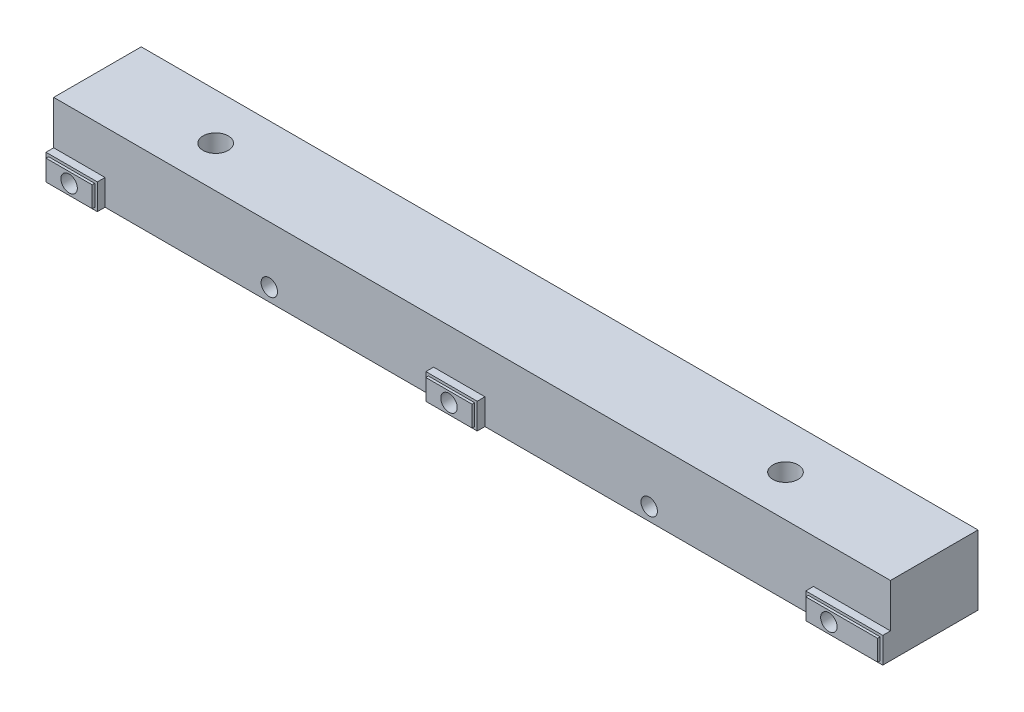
ISO-10303-21;
HEADER;
FILE_DESCRIPTION(('STEP AP214'),'2;1');
FILE_NAME('part.step','',(''),(''),'','','');
FILE_SCHEMA(('AUTOMOTIVE_DESIGN { 1 0 10303 214 1 1 1 1 }'));
ENDSEC;
DATA;
#1=APPLICATION_CONTEXT('core data for automotive mechanical design processes');
#2=APPLICATION_PROTOCOL_DEFINITION('international standard','automotive_design',2000,#1);
#3=PRODUCT_CONTEXT('',#1,'mechanical');
#4=PRODUCT('Part','Part','',(#3));
#5=PRODUCT_RELATED_PRODUCT_CATEGORY('part','',(#4));
#6=PRODUCT_DEFINITION_FORMATION('','',#4);
#7=PRODUCT_DEFINITION_CONTEXT('part definition',#1,'design');
#8=PRODUCT_DEFINITION('design','',#6,#7);
#9=PRODUCT_DEFINITION_SHAPE('','',#8);
#10=(LENGTH_UNIT() NAMED_UNIT(*) SI_UNIT(.MILLI.,.METRE.));
#11=(NAMED_UNIT(*) PLANE_ANGLE_UNIT() SI_UNIT($,.RADIAN.));
#12=(NAMED_UNIT(*) SI_UNIT($,.STERADIAN.) SOLID_ANGLE_UNIT());
#13=UNCERTAINTY_MEASURE_WITH_UNIT(LENGTH_MEASURE(1.E-05),#10,'distance_accuracy_value','');
#14=(GEOMETRIC_REPRESENTATION_CONTEXT(3) GLOBAL_UNCERTAINTY_ASSIGNED_CONTEXT((#13)) GLOBAL_UNIT_ASSIGNED_CONTEXT((#10,
#11,#12)) REPRESENTATION_CONTEXT('',''));
#15=CARTESIAN_POINT('',(0.,0.,0.));
#16=DIRECTION('',(0.,0.,1.));
#17=DIRECTION('',(1.,0.,0.));
#18=AXIS2_PLACEMENT_3D('',#15,#16,#17);
#19=CARTESIAN_POINT('',(-208.,0.,8.525));
#20=DIRECTION('',(0.,1.,0.));
#21=DIRECTION('',(0.,0.,1.));
#22=AXIS2_PLACEMENT_3D('',#19,#20,#21);
#23=PLANE('',#22);
#24=CARTESIAN_POINT('',(179.5,0.,0.475000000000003));
#25=DIRECTION('',(0.,-1.,0.));
#26=DIRECTION('',(0.,0.,-1.));
#27=AXIS2_PLACEMENT_3D('',#24,#25,#26);
#28=CIRCLE('',#27,2.79399999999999);
#29=CARTESIAN_POINT('',(179.5,0.,-2.31899999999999));
#30=VERTEX_POINT('',#29);
#31=EDGE_CURVE('E552',#30,#30,#28,.T.);
#32=ORIENTED_EDGE('',*,*,#31,.F.);
#33=EDGE_LOOP('',(#32));
#34=FACE_BOUND('',#33,.T.);
#35=CARTESIAN_POINT('',(68.4999999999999,0.,0.474999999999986));
#36=DIRECTION('',(0.,-1.,0.));
#37=DIRECTION('',(0.,0.,-1.));
#38=AXIS2_PLACEMENT_3D('',#35,#36,#37);
#39=CIRCLE('',#38,2.794);
#40=CARTESIAN_POINT('',(68.4999999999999,0.,-2.31900000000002));
#41=VERTEX_POINT('',#40);
#42=EDGE_CURVE('E563',#41,#41,#39,.T.);
#43=ORIENTED_EDGE('',*,*,#42,.F.);
#44=EDGE_LOOP('',(#43));
#45=FACE_BOUND('',#44,.T.);
#46=DIRECTION('',(1.,0.,0.));
#47=VECTOR('',#46,1.);
#48=CARTESIAN_POINT('',(-208.,0.,8.525));
#49=LINE('',#48,#47);
#50=CARTESIAN_POINT('',(129.,0.,8.525));
#51=VERTEX_POINT('',#50);
#52=CARTESIAN_POINT('',(193.,0.,8.525));
#53=VERTEX_POINT('',#52);
#54=EDGE_CURVE('E436',#51,#53,#49,.T.);
#55=ORIENTED_EDGE('',*,*,#54,.F.);
#56=DIRECTION('',(0.,0.,-1.));
#57=VECTOR('',#56,1.);
#58=CARTESIAN_POINT('',(129.,0.,10.525));
#59=LINE('',#58,#57);
#60=CARTESIAN_POINT('',(129.,0.,10.025));
#61=VERTEX_POINT('',#60);
#62=EDGE_CURVE('E427',#61,#51,#59,.T.);
#63=ORIENTED_EDGE('',*,*,#62,.F.);
#64=DIRECTION('',(1.,0.,0.));
#65=VECTOR('',#64,1.);
#66=CARTESIAN_POINT('',(119.,0.,10.025));
#67=LINE('',#66,#65);
#68=CARTESIAN_POINT('',(119.,0.,10.025));
#69=VERTEX_POINT('',#68);
#70=EDGE_CURVE('E306',#69,#61,#67,.T.);
#71=ORIENTED_EDGE('',*,*,#70,.F.);
#72=DIRECTION('',(0.,0.,-1.));
#73=VECTOR('',#72,1.);
#74=CARTESIAN_POINT('',(119.,0.,10.525));
#75=LINE('',#74,#73);
#76=CARTESIAN_POINT('',(119.,0.,8.525));
#77=VERTEX_POINT('',#76);
#78=EDGE_CURVE('E430',#69,#77,#75,.T.);
#79=ORIENTED_EDGE('',*,*,#78,.T.);
#80=CARTESIAN_POINT('',(55.,0.,8.525));
#81=VERTEX_POINT('',#80);
#82=EDGE_CURVE('E446',#81,#77,#49,.T.);
#83=ORIENTED_EDGE('',*,*,#82,.F.);
#84=DIRECTION('',(0.,0.,-1.));
#85=VECTOR('',#84,1.);
#86=CARTESIAN_POINT('',(55.,0.,10.525));
#87=LINE('',#86,#85);
#88=CARTESIAN_POINT('',(55.,0.,10.025));
#89=VERTEX_POINT('',#88);
#90=EDGE_CURVE('E411',#89,#81,#87,.T.);
#91=ORIENTED_EDGE('',*,*,#90,.F.);
#92=DIRECTION('',(1.,0.,0.));
#93=VECTOR('',#92,1.);
#94=CARTESIAN_POINT('',(45.,0.,10.025));
#95=LINE('',#94,#93);
#96=CARTESIAN_POINT('',(45.,0.,10.025));
#97=VERTEX_POINT('',#96);
#98=EDGE_CURVE('E347',#97,#89,#95,.T.);
#99=ORIENTED_EDGE('',*,*,#98,.F.);
#100=DIRECTION('',(0.,0.,-1.));
#101=VECTOR('',#100,1.);
#102=CARTESIAN_POINT('',(45.,0.,10.525));
#103=LINE('',#102,#101);
#104=CARTESIAN_POINT('',(44.9999999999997,0.,-8.525));
#105=VERTEX_POINT('',#104);
#106=EDGE_CURVE('E48',#97,#105,#103,.T.);
#107=ORIENTED_EDGE('',*,*,#106,.T.);
#108=DIRECTION('',(-1.,0.,0.));
#109=VECTOR('',#108,1.);
#110=CARTESIAN_POINT('',(-208.,0.,-8.525));
#111=LINE('',#110,#109);
#112=CARTESIAN_POINT('',(208.,0.,-8.525));
#113=VERTEX_POINT('',#112);
#114=EDGE_CURVE('E219',#113,#105,#111,.T.);
#115=ORIENTED_EDGE('',*,*,#114,.F.);
#116=DIRECTION('',(0.,0.,-1.));
#117=VECTOR('',#116,1.);
#118=CARTESIAN_POINT('',(208.,0.,-8.525));
#119=LINE('',#118,#117);
#120=CARTESIAN_POINT('',(208.,0.,10.025));
#121=VERTEX_POINT('',#120);
#122=EDGE_CURVE('E442',#121,#113,#119,.T.);
#123=ORIENTED_EDGE('',*,*,#122,.F.);
#124=DIRECTION('',(1.,0.,0.));
#125=VECTOR('',#124,1.);
#126=CARTESIAN_POINT('',(193.,0.,10.025));
#127=LINE('',#126,#125);
#128=CARTESIAN_POINT('',(193.,0.,10.025));
#129=VERTEX_POINT('',#128);
#130=EDGE_CURVE('E265',#129,#121,#127,.T.);
#131=ORIENTED_EDGE('',*,*,#130,.F.);
#132=DIRECTION('',(0.,0.,-1.));
#133=VECTOR('',#132,1.);
#134=CARTESIAN_POINT('',(193.,0.,10.525));
#135=LINE('',#134,#133);
#136=EDGE_CURVE('E400',#129,#53,#135,.T.);
#137=ORIENTED_EDGE('',*,*,#136,.T.);
#138=EDGE_LOOP('',(#55,#63,#71,#79,#83,#91,#99,#107,#115,#123,#131,#137));
#139=FACE_BOUND('',#138,.T.);
#140=ADVANCED_FACE('F31',(#34,#45,#139),#23,.F.);
#141=CARTESIAN_POINT('',(161.,2.515,-8.525));
#142=DIRECTION('',(0.,0.,-1.));
#143=DIRECTION('',(-1.,0.,0.));
#144=AXIS2_PLACEMENT_3D('',#141,#142,#143);
#145=CYLINDRICAL_SURFACE('',#144,1.59999999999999);
#146=CARTESIAN_POINT('',(161.,2.515,-8.425));
#147=DIRECTION('',(0.,0.,-1.));
#148=DIRECTION('',(-1.,0.,0.));
#149=AXIS2_PLACEMENT_3D('',#146,#147,#148);
#150=CIRCLE('',#149,1.59999999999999);
#151=CARTESIAN_POINT('',(159.4,2.515,-8.425));
#152=VERTEX_POINT('',#151);
#153=EDGE_CURVE('E384',#152,#152,#150,.T.);
#154=ORIENTED_EDGE('',*,*,#153,.T.);
#155=EDGE_LOOP('',(#154));
#156=FACE_BOUND('',#155,.T.);
#157=CARTESIAN_POINT('',(161.,2.515,8.525));
#158=DIRECTION('',(0.,0.,1.));
#159=DIRECTION('',(1.,0.,0.));
#160=AXIS2_PLACEMENT_3D('',#157,#158,#159);
#161=CIRCLE('',#160,1.59999999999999);
#162=CARTESIAN_POINT('',(162.6,2.515,8.525));
#163=VERTEX_POINT('',#162);
#164=EDGE_CURVE('E35',#163,#163,#161,.F.);
#165=ORIENTED_EDGE('',*,*,#164,.F.);
#166=EDGE_LOOP('',(#165));
#167=FACE_BOUND('',#166,.T.);
#168=ADVANCED_FACE('F511',(#156,#167),#145,.F.);
#169=CARTESIAN_POINT('',(87.,2.515,-8.525));
#170=DIRECTION('',(0.,0.,-1.));
#171=DIRECTION('',(-1.,0.,0.));
#172=AXIS2_PLACEMENT_3D('',#169,#170,#171);
#173=CYLINDRICAL_SURFACE('',#172,1.6);
#174=CARTESIAN_POINT('',(87.,2.515,-8.425));
#175=DIRECTION('',(0.,0.,-1.));
#176=DIRECTION('',(-1.,0.,0.));
#177=AXIS2_PLACEMENT_3D('',#174,#175,#176);
#178=CIRCLE('',#177,1.6);
#179=CARTESIAN_POINT('',(85.4,2.515,-8.425));
#180=VERTEX_POINT('',#179);
#181=EDGE_CURVE('E371',#180,#180,#178,.T.);
#182=ORIENTED_EDGE('',*,*,#181,.T.);
#183=EDGE_LOOP('',(#182));
#184=FACE_BOUND('',#183,.T.);
#185=CARTESIAN_POINT('',(87.,2.515,8.525));
#186=DIRECTION('',(0.,0.,1.));
#187=DIRECTION('',(1.,0.,0.));
#188=AXIS2_PLACEMENT_3D('',#185,#186,#187);
#189=CIRCLE('',#188,1.6);
#190=CARTESIAN_POINT('',(88.6,2.515,8.525));
#191=VERTEX_POINT('',#190);
#192=EDGE_CURVE('E565',#191,#191,#189,.F.);
#193=ORIENTED_EDGE('',*,*,#192,.F.);
#194=EDGE_LOOP('',(#193));
#195=FACE_BOUND('',#194,.T.);
#196=ADVANCED_FACE('F518',(#184,#195),#173,.F.);
#197=CARTESIAN_POINT('',(-208.,13.54,8.525));
#198=DIRECTION('',(0.,1.,0.));
#199=DIRECTION('',(0.,0.,1.));
#200=AXIS2_PLACEMENT_3D('',#197,#198,#199);
#201=PLANE('',#200);
#202=CARTESIAN_POINT('',(179.5,13.54,0.475000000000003));
#203=DIRECTION('',(0.,-1.,0.));
#204=DIRECTION('',(0.,0.,-1.));
#205=AXIS2_PLACEMENT_3D('',#202,#203,#204);
#206=CIRCLE('',#205,2.45745);
#207=CARTESIAN_POINT('',(179.5,13.54,-1.98245));
#208=VERTEX_POINT('',#207);
#209=EDGE_CURVE('E233',#208,#208,#206,.T.);
#210=ORIENTED_EDGE('',*,*,#209,.T.);
#211=EDGE_LOOP('',(#210));
#212=FACE_BOUND('',#211,.T.);
#213=DIRECTION('',(0.,0.,-1.));
#214=VECTOR('',#213,1.);
#215=CARTESIAN_POINT('',(44.9999999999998,13.54,8.52500000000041));
#216=LINE('',#215,#214);
#217=CARTESIAN_POINT('',(44.9999999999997,13.54,8.525));
#218=VERTEX_POINT('',#217);
#219=CARTESIAN_POINT('',(44.9999999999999,13.54,-8.525));
#220=VERTEX_POINT('',#219);
#221=EDGE_CURVE('E11',#218,#220,#216,.T.);
#222=ORIENTED_EDGE('',*,*,#221,.F.);
#223=DIRECTION('',(1.,0.,0.));
#224=VECTOR('',#223,1.);
#225=CARTESIAN_POINT('',(-208.,13.54,8.525));
#226=LINE('',#225,#224);
#227=CARTESIAN_POINT('',(208.,13.54,8.525));
#228=VERTEX_POINT('',#227);
#229=EDGE_CURVE('E437',#218,#228,#226,.T.);
#230=ORIENTED_EDGE('',*,*,#229,.T.);
#231=DIRECTION('',(0.,0.,-1.));
#232=VECTOR('',#231,1.);
#233=CARTESIAN_POINT('',(208.,13.54,-8.525));
#234=LINE('',#233,#232);
#235=CARTESIAN_POINT('',(208.,13.54,-8.525));
#236=VERTEX_POINT('',#235);
#237=EDGE_CURVE('E209',#228,#236,#234,.T.);
#238=ORIENTED_EDGE('',*,*,#237,.T.);
#239=DIRECTION('',(-1.,0.,0.));
#240=VECTOR('',#239,1.);
#241=CARTESIAN_POINT('',(-208.,13.54,-8.525));
#242=LINE('',#241,#240);
#243=EDGE_CURVE('E204',#236,#220,#242,.T.);
#244=ORIENTED_EDGE('',*,*,#243,.T.);
#245=EDGE_LOOP('',(#222,#230,#238,#244));
#246=FACE_BOUND('',#245,.T.);
#247=CARTESIAN_POINT('',(68.4999999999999,13.54,0.474999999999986));
#248=DIRECTION('',(0.,-1.,0.));
#249=DIRECTION('',(0.,0.,-1.));
#250=AXIS2_PLACEMENT_3D('',#247,#248,#249);
#251=CIRCLE('',#250,2.45745);
#252=CARTESIAN_POINT('',(68.4999999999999,13.54,-1.98245000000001));
#253=VERTEX_POINT('',#252);
#254=EDGE_CURVE('E555',#253,#253,#251,.T.);
#255=ORIENTED_EDGE('',*,*,#254,.T.);
#256=EDGE_LOOP('',(#255));
#257=FACE_BOUND('',#256,.T.);
#258=ADVANCED_FACE('F206',(#212,#246,#257),#201,.T.);
#259=CARTESIAN_POINT('',(208.,13.54,-8.525));
#260=DIRECTION('',(-1.,0.,0.));
#261=DIRECTION('',(0.,0.,1.));
#262=AXIS2_PLACEMENT_3D('',#259,#260,#261);
#263=PLANE('',#262);
#264=DIRECTION('',(0.,1.,0.));
#265=VECTOR('',#264,1.);
#266=CARTESIAN_POINT('',(208.,0.,10.025));
#267=LINE('',#266,#265);
#268=CARTESIAN_POINT('',(208.,5.03,10.025));
#269=VERTEX_POINT('',#268);
#270=EDGE_CURVE('E273',#121,#269,#267,.T.);
#271=ORIENTED_EDGE('',*,*,#270,.F.);
#272=ORIENTED_EDGE('',*,*,#122,.T.);
#273=DIRECTION('',(0.,-1.,0.));
#274=VECTOR('',#273,1.);
#275=CARTESIAN_POINT('',(208.,13.54,-8.525));
#276=LINE('',#275,#274);
#277=EDGE_CURVE('E213',#236,#113,#276,.T.);
#278=ORIENTED_EDGE('',*,*,#277,.F.);
#279=ORIENTED_EDGE('',*,*,#237,.F.);
#280=DIRECTION('',(0.,-1.,0.));
#281=VECTOR('',#280,1.);
#282=CARTESIAN_POINT('',(208.,13.54,8.525));
#283=LINE('',#282,#281);
#284=CARTESIAN_POINT('',(208.,5.03,8.525));
#285=VERTEX_POINT('',#284);
#286=EDGE_CURVE('E40',#228,#285,#283,.T.);
#287=ORIENTED_EDGE('',*,*,#286,.T.);
#288=DIRECTION('',(0.,0.,-1.));
#289=VECTOR('',#288,1.);
#290=CARTESIAN_POINT('',(208.,5.03,10.525));
#291=LINE('',#290,#289);
#292=EDGE_CURVE('E404',#269,#285,#291,.T.);
#293=ORIENTED_EDGE('',*,*,#292,.F.);
#294=EDGE_LOOP('',(#271,#272,#278,#279,#287,#293));
#295=FACE_BOUND('',#294,.T.);
#296=ADVANCED_FACE('F490',(#295),#263,.F.);
#297=CARTESIAN_POINT('',(208.,5.03,10.525));
#298=DIRECTION('',(0.,1.,0.));
#299=DIRECTION('',(0.,0.,1.));
#300=AXIS2_PLACEMENT_3D('',#297,#298,#299);
#301=PLANE('',#300);
#302=DIRECTION('',(0.,0.,-1.));
#303=VECTOR('',#302,1.);
#304=CARTESIAN_POINT('',(193.,5.03,10.525));
#305=LINE('',#304,#303);
#306=CARTESIAN_POINT('',(193.,5.03,10.025));
#307=VERTEX_POINT('',#306);
#308=CARTESIAN_POINT('',(193.,5.03,8.525));
#309=VERTEX_POINT('',#308);
#310=EDGE_CURVE('E402',#307,#309,#305,.T.);
#311=ORIENTED_EDGE('',*,*,#310,.F.);
#312=DIRECTION('',(-1.,0.,0.));
#313=VECTOR('',#312,1.);
#314=CARTESIAN_POINT('',(208.,5.03,10.025));
#315=LINE('',#314,#313);
#316=EDGE_CURVE('E275',#269,#307,#315,.T.);
#317=ORIENTED_EDGE('',*,*,#316,.F.);
#318=ORIENTED_EDGE('',*,*,#292,.T.);
#319=DIRECTION('',(1.,0.,0.));
#320=VECTOR('',#319,1.);
#321=CARTESIAN_POINT('',(208.,5.03,8.525));
#322=LINE('',#321,#320);
#323=EDGE_CURVE('E394',#309,#285,#322,.T.);
#324=ORIENTED_EDGE('',*,*,#323,.F.);
#325=EDGE_LOOP('',(#311,#317,#318,#324));
#326=FACE_BOUND('',#325,.T.);
#327=ADVANCED_FACE('F487',(#326),#301,.T.);
#328=CARTESIAN_POINT('',(193.,5.03,10.525));
#329=DIRECTION('',(-1.,0.,0.));
#330=DIRECTION('',(0.,0.,1.));
#331=AXIS2_PLACEMENT_3D('',#328,#329,#330);
#332=PLANE('',#331);
#333=ORIENTED_EDGE('',*,*,#136,.F.);
#334=DIRECTION('',(0.,-1.,0.));
#335=VECTOR('',#334,1.);
#336=CARTESIAN_POINT('',(193.,5.03,10.025));
#337=LINE('',#336,#335);
#338=EDGE_CURVE('E277',#307,#129,#337,.T.);
#339=ORIENTED_EDGE('',*,*,#338,.F.);
#340=ORIENTED_EDGE('',*,*,#310,.T.);
#341=DIRECTION('',(0.,1.,0.));
#342=VECTOR('',#341,1.);
#343=CARTESIAN_POINT('',(193.,5.03,8.525));
#344=LINE('',#343,#342);
#345=EDGE_CURVE('E397',#53,#309,#344,.T.);
#346=ORIENTED_EDGE('',*,*,#345,.F.);
#347=EDGE_LOOP('',(#333,#339,#340,#346));
#348=FACE_BOUND('',#347,.T.);
#349=ADVANCED_FACE('F482',(#348),#332,.T.);
#350=CARTESIAN_POINT('',(208.,0.,10.525));
#351=DIRECTION('',(0.,0.,1.));
#352=DIRECTION('',(-1.,0.,0.));
#353=AXIS2_PLACEMENT_3D('',#350,#351,#352);
#354=PLANE('',#353);
#355=CARTESIAN_POINT('',(198.,2.515,10.525));
#356=DIRECTION('',(0.,0.,1.));
#357=DIRECTION('',(1.,0.,0.));
#358=AXIS2_PLACEMENT_3D('',#355,#356,#357);
#359=CIRCLE('',#358,1.59999999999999);
#360=CARTESIAN_POINT('',(199.6,2.515,10.525));
#361=VERTEX_POINT('',#360);
#362=EDGE_CURVE('E393',#361,#361,#359,.T.);
#363=ORIENTED_EDGE('',*,*,#362,.F.);
#364=EDGE_LOOP('',(#363));
#365=FACE_BOUND('',#364,.T.);
#366=DIRECTION('',(0.,-1.,0.));
#367=VECTOR('',#366,1.);
#368=CARTESIAN_POINT('',(193.5,4.53,10.525));
#369=LINE('',#368,#367);
#370=CARTESIAN_POINT('',(193.5,4.53,10.525));
#371=VERTEX_POINT('',#370);
#372=CARTESIAN_POINT('',(193.5,0.5,10.525));
#373=VERTEX_POINT('',#372);
#374=EDGE_CURVE('E243',#371,#373,#369,.T.);
#375=ORIENTED_EDGE('',*,*,#374,.T.);
#376=DIRECTION('',(1.,0.,0.));
#377=VECTOR('',#376,1.);
#378=CARTESIAN_POINT('',(193.5,0.5,10.525));
#379=LINE('',#378,#377);
#380=CARTESIAN_POINT('',(207.5,0.5,10.525));
#381=VERTEX_POINT('',#380);
#382=EDGE_CURVE('E221',#373,#381,#379,.T.);
#383=ORIENTED_EDGE('',*,*,#382,.T.);
#384=DIRECTION('',(0.,1.,0.));
#385=VECTOR('',#384,1.);
#386=CARTESIAN_POINT('',(207.5,0.5,10.525));
#387=LINE('',#386,#385);
#388=CARTESIAN_POINT('',(207.5,4.53,10.525));
#389=VERTEX_POINT('',#388);
#390=EDGE_CURVE('E255',#381,#389,#387,.T.);
#391=ORIENTED_EDGE('',*,*,#390,.T.);
#392=DIRECTION('',(-1.,0.,0.));
#393=VECTOR('',#392,1.);
#394=CARTESIAN_POINT('',(207.5,4.53,10.525));
#395=LINE('',#394,#393);
#396=EDGE_CURVE('E258',#389,#371,#395,.T.);
#397=ORIENTED_EDGE('',*,*,#396,.T.);
#398=EDGE_LOOP('',(#375,#383,#391,#397));
#399=FACE_BOUND('',#398,.T.);
#400=ADVANCED_FACE('F581',(#365,#399),#354,.T.);
#401=CARTESIAN_POINT('',(129.,5.03,10.525));
#402=DIRECTION('',(1.,0.,0.));
#403=DIRECTION('',(0.,0.,-1.));
#404=AXIS2_PLACEMENT_3D('',#401,#402,#403);
#405=PLANE('',#404);
#406=DIRECTION('',(0.,0.,-1.));
#407=VECTOR('',#406,1.);
#408=CARTESIAN_POINT('',(129.,5.03,10.525));
#409=LINE('',#408,#407);
#410=CARTESIAN_POINT('',(129.,5.03,10.025));
#411=VERTEX_POINT('',#410);
#412=CARTESIAN_POINT('',(129.,5.03,8.525));
#413=VERTEX_POINT('',#412);
#414=EDGE_CURVE('E434',#411,#413,#409,.T.);
#415=ORIENTED_EDGE('',*,*,#414,.F.);
#416=DIRECTION('',(0.,1.,0.));
#417=VECTOR('',#416,1.);
#418=CARTESIAN_POINT('',(129.,0.,10.025));
#419=LINE('',#418,#417);
#420=EDGE_CURVE('E314',#61,#411,#419,.T.);
#421=ORIENTED_EDGE('',*,*,#420,.F.);
#422=ORIENTED_EDGE('',*,*,#62,.T.);
#423=DIRECTION('',(0.,-1.,0.));
#424=VECTOR('',#423,1.);
#425=CARTESIAN_POINT('',(129.,5.03,8.525));
#426=LINE('',#425,#424);
#427=EDGE_CURVE('E418',#413,#51,#426,.T.);
#428=ORIENTED_EDGE('',*,*,#427,.F.);
#429=EDGE_LOOP('',(#415,#421,#422,#428));
#430=FACE_BOUND('',#429,.T.);
#431=ADVANCED_FACE('F473',(#430),#405,.T.);
#432=CARTESIAN_POINT('',(129.,5.03,10.525));
#433=DIRECTION('',(0.,1.,0.));
#434=DIRECTION('',(0.,0.,1.));
#435=AXIS2_PLACEMENT_3D('',#432,#433,#434);
#436=PLANE('',#435);
#437=DIRECTION('',(0.,0.,-1.));
#438=VECTOR('',#437,1.);
#439=CARTESIAN_POINT('',(119.,5.03,10.525));
#440=LINE('',#439,#438);
#441=CARTESIAN_POINT('',(119.,5.03,10.025));
#442=VERTEX_POINT('',#441);
#443=CARTESIAN_POINT('',(119.,5.03,8.525));
#444=VERTEX_POINT('',#443);
#445=EDGE_CURVE('E432',#442,#444,#440,.T.);
#446=ORIENTED_EDGE('',*,*,#445,.F.);
#447=DIRECTION('',(-1.,0.,0.));
#448=VECTOR('',#447,1.);
#449=CARTESIAN_POINT('',(129.,5.03,10.025));
#450=LINE('',#449,#448);
#451=EDGE_CURVE('E316',#411,#442,#450,.T.);
#452=ORIENTED_EDGE('',*,*,#451,.F.);
#453=ORIENTED_EDGE('',*,*,#414,.T.);
#454=DIRECTION('',(1.,0.,0.));
#455=VECTOR('',#454,1.);
#456=CARTESIAN_POINT('',(129.,5.03,8.525));
#457=LINE('',#456,#455);
#458=EDGE_CURVE('E421',#444,#413,#457,.T.);
#459=ORIENTED_EDGE('',*,*,#458,.F.);
#460=EDGE_LOOP('',(#446,#452,#453,#459));
#461=FACE_BOUND('',#460,.T.);
#462=ADVANCED_FACE('F469',(#461),#436,.T.);
#463=CARTESIAN_POINT('',(119.,5.03,10.525));
#464=DIRECTION('',(-1.,0.,0.));
#465=DIRECTION('',(0.,0.,1.));
#466=AXIS2_PLACEMENT_3D('',#463,#464,#465);
#467=PLANE('',#466);
#468=ORIENTED_EDGE('',*,*,#78,.F.);
#469=DIRECTION('',(0.,-1.,0.));
#470=VECTOR('',#469,1.);
#471=CARTESIAN_POINT('',(119.,5.03,10.025));
#472=LINE('',#471,#470);
#473=EDGE_CURVE('E318',#442,#69,#472,.T.);
#474=ORIENTED_EDGE('',*,*,#473,.F.);
#475=ORIENTED_EDGE('',*,*,#445,.T.);
#476=DIRECTION('',(0.,1.,0.));
#477=VECTOR('',#476,1.);
#478=CARTESIAN_POINT('',(119.,5.03,8.525));
#479=LINE('',#478,#477);
#480=EDGE_CURVE('E424',#77,#444,#479,.T.);
#481=ORIENTED_EDGE('',*,*,#480,.F.);
#482=EDGE_LOOP('',(#468,#474,#475,#481));
#483=FACE_BOUND('',#482,.T.);
#484=ADVANCED_FACE('F464',(#483),#467,.T.);
#485=CARTESIAN_POINT('',(129.,0.,10.525));
#486=DIRECTION('',(0.,0.,1.));
#487=DIRECTION('',(-1.,0.,0.));
#488=AXIS2_PLACEMENT_3D('',#485,#486,#487);
#489=PLANE('',#488);
#490=CARTESIAN_POINT('',(124.,2.515,10.525));
#491=DIRECTION('',(0.,0.,1.));
#492=DIRECTION('',(1.,0.,0.));
#493=AXIS2_PLACEMENT_3D('',#490,#491,#492);
#494=CIRCLE('',#493,1.6);
#495=CARTESIAN_POINT('',(125.6,2.515,10.525));
#496=VERTEX_POINT('',#495);
#497=EDGE_CURVE('E380',#496,#496,#494,.T.);
#498=ORIENTED_EDGE('',*,*,#497,.F.);
#499=EDGE_LOOP('',(#498));
#500=FACE_BOUND('',#499,.T.);
#501=DIRECTION('',(0.,-1.,0.));
#502=VECTOR('',#501,1.);
#503=CARTESIAN_POINT('',(119.5,4.53,10.525));
#504=LINE('',#503,#502);
#505=CARTESIAN_POINT('',(119.5,4.53,10.525));
#506=VERTEX_POINT('',#505);
#507=CARTESIAN_POINT('',(119.5,0.5,10.525));
#508=VERTEX_POINT('',#507);
#509=EDGE_CURVE('E284',#506,#508,#504,.T.);
#510=ORIENTED_EDGE('',*,*,#509,.T.);
#511=DIRECTION('',(1.,0.,0.));
#512=VECTOR('',#511,1.);
#513=CARTESIAN_POINT('',(119.5,0.5,10.525));
#514=LINE('',#513,#512);
#515=CARTESIAN_POINT('',(128.5,0.5,10.525));
#516=VERTEX_POINT('',#515);
#517=EDGE_CURVE('E279',#508,#516,#514,.T.);
#518=ORIENTED_EDGE('',*,*,#517,.T.);
#519=DIRECTION('',(0.,1.,0.));
#520=VECTOR('',#519,1.);
#521=CARTESIAN_POINT('',(128.5,0.5,10.525));
#522=LINE('',#521,#520);
#523=CARTESIAN_POINT('',(128.5,4.53,10.525));
#524=VERTEX_POINT('',#523);
#525=EDGE_CURVE('E296',#516,#524,#522,.T.);
#526=ORIENTED_EDGE('',*,*,#525,.T.);
#527=DIRECTION('',(-1.,0.,0.));
#528=VECTOR('',#527,1.);
#529=CARTESIAN_POINT('',(128.5,4.53,10.525));
#530=LINE('',#529,#528);
#531=EDGE_CURVE('E299',#524,#506,#530,.T.);
#532=ORIENTED_EDGE('',*,*,#531,.T.);
#533=EDGE_LOOP('',(#510,#518,#526,#532));
#534=FACE_BOUND('',#533,.T.);
#535=ADVANCED_FACE('F761',(#500,#534),#489,.T.);
#536=CARTESIAN_POINT('',(55.,5.03,10.525));
#537=DIRECTION('',(1.,0.,0.));
#538=DIRECTION('',(0.,0.,-1.));
#539=AXIS2_PLACEMENT_3D('',#536,#537,#538);
#540=PLANE('',#539);
#541=DIRECTION('',(0.,0.,-1.));
#542=VECTOR('',#541,1.);
#543=CARTESIAN_POINT('',(55.,5.03,10.525));
#544=LINE('',#543,#542);
#545=CARTESIAN_POINT('',(55.,5.03,10.025));
#546=VERTEX_POINT('',#545);
#547=CARTESIAN_POINT('',(55.,5.03,8.525));
#548=VERTEX_POINT('',#547);
#549=EDGE_CURVE('E416',#546,#548,#544,.T.);
#550=ORIENTED_EDGE('',*,*,#549,.F.);
#551=DIRECTION('',(0.,1.,0.));
#552=VECTOR('',#551,1.);
#553=CARTESIAN_POINT('',(55.,0.,10.025));
#554=LINE('',#553,#552);
#555=EDGE_CURVE('E355',#89,#546,#554,.T.);
#556=ORIENTED_EDGE('',*,*,#555,.F.);
#557=ORIENTED_EDGE('',*,*,#90,.T.);
#558=DIRECTION('',(0.,-1.,0.));
#559=VECTOR('',#558,1.);
#560=CARTESIAN_POINT('',(55.,5.03,8.525));
#561=LINE('',#560,#559);
#562=EDGE_CURVE('E406',#548,#81,#561,.T.);
#563=ORIENTED_EDGE('',*,*,#562,.F.);
#564=EDGE_LOOP('',(#550,#556,#557,#563));
#565=FACE_BOUND('',#564,.T.);
#566=ADVANCED_FACE('F752',(#565),#540,.T.);
#567=CARTESIAN_POINT('',(55.,5.03,10.525));
#568=DIRECTION('',(0.,1.,0.));
#569=DIRECTION('',(0.,0.,1.));
#570=AXIS2_PLACEMENT_3D('',#567,#568,#569);
#571=PLANE('',#570);
#572=DIRECTION('',(0.,0.,-1.));
#573=VECTOR('',#572,1.);
#574=CARTESIAN_POINT('',(45.,5.03,10.525));
#575=LINE('',#574,#573);
#576=CARTESIAN_POINT('',(45.,5.03,10.025));
#577=VERTEX_POINT('',#576);
#578=CARTESIAN_POINT('',(45.,5.03,8.525));
#579=VERTEX_POINT('',#578);
#580=EDGE_CURVE('E229',#577,#579,#575,.T.);
#581=ORIENTED_EDGE('',*,*,#580,.F.);
#582=DIRECTION('',(-1.,0.,0.));
#583=VECTOR('',#582,1.);
#584=CARTESIAN_POINT('',(55.,5.03,10.025));
#585=LINE('',#584,#583);
#586=EDGE_CURVE('E357',#546,#577,#585,.T.);
#587=ORIENTED_EDGE('',*,*,#586,.F.);
#588=ORIENTED_EDGE('',*,*,#549,.T.);
#589=DIRECTION('',(1.,0.,0.));
#590=VECTOR('',#589,1.);
#591=CARTESIAN_POINT('',(55.,5.03,8.525));
#592=LINE('',#591,#590);
#593=EDGE_CURVE('E409',#579,#548,#592,.T.);
#594=ORIENTED_EDGE('',*,*,#593,.F.);
#595=EDGE_LOOP('',(#581,#587,#588,#594));
#596=FACE_BOUND('',#595,.T.);
#597=ADVANCED_FACE('F741',(#596),#571,.T.);
#598=CARTESIAN_POINT('',(45.,5.03,10.525));
#599=DIRECTION('',(-1.,0.,0.));
#600=DIRECTION('',(0.,0.,1.));
#601=AXIS2_PLACEMENT_3D('',#598,#599,#600);
#602=PLANE('',#601);
#603=ORIENTED_EDGE('',*,*,#106,.F.);
#604=DIRECTION('',(0.,-1.,0.));
#605=VECTOR('',#604,1.);
#606=CARTESIAN_POINT('',(45.,5.03,10.025));
#607=LINE('',#606,#605);
#608=EDGE_CURVE('E359',#577,#97,#607,.T.);
#609=ORIENTED_EDGE('',*,*,#608,.F.);
#610=ORIENTED_EDGE('',*,*,#580,.T.);
#611=DIRECTION('',(0.,1.,0.));
#612=VECTOR('',#611,1.);
#613=CARTESIAN_POINT('',(44.9999999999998,-520.820019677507,8.525));
#614=LINE('',#613,#612);
#615=EDGE_CURVE('E222',#579,#218,#614,.T.);
#616=ORIENTED_EDGE('',*,*,#615,.T.);
#617=ORIENTED_EDGE('',*,*,#221,.T.);
#618=DIRECTION('',(0.,1.,0.));
#619=VECTOR('',#618,1.);
#620=CARTESIAN_POINT('',(44.9999999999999,-520.820019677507,-8.525));
#621=LINE('',#620,#619);
#622=EDGE_CURVE('E216',#105,#220,#621,.T.);
#623=ORIENTED_EDGE('',*,*,#622,.F.);
#624=EDGE_LOOP('',(#603,#609,#610,#616,#617,#623));
#625=FACE_BOUND('',#624,.T.);
#626=ADVANCED_FACE('F225',(#625),#602,.T.);
#627=CARTESIAN_POINT('',(55.,0.,10.525));
#628=DIRECTION('',(0.,0.,1.));
#629=DIRECTION('',(-1.,0.,0.));
#630=AXIS2_PLACEMENT_3D('',#627,#628,#629);
#631=PLANE('',#630);
#632=CARTESIAN_POINT('',(50.,2.515,10.525));
#633=DIRECTION('',(0.,0.,1.));
#634=DIRECTION('',(1.,0.,0.));
#635=AXIS2_PLACEMENT_3D('',#632,#633,#634);
#636=CIRCLE('',#635,1.6);
#637=CARTESIAN_POINT('',(51.6,2.515,10.525));
#638=VERTEX_POINT('',#637);
#639=EDGE_CURVE('E367',#638,#638,#636,.T.);
#640=ORIENTED_EDGE('',*,*,#639,.F.);
#641=EDGE_LOOP('',(#640));
#642=FACE_BOUND('',#641,.T.);
#643=DIRECTION('',(0.,-1.,0.));
#644=VECTOR('',#643,1.);
#645=CARTESIAN_POINT('',(45.5,4.53,10.525));
#646=LINE('',#645,#644);
#647=CARTESIAN_POINT('',(45.5,4.53,10.525));
#648=VERTEX_POINT('',#647);
#649=CARTESIAN_POINT('',(45.5,0.5,10.525));
#650=VERTEX_POINT('',#649);
#651=EDGE_CURVE('E325',#648,#650,#646,.T.);
#652=ORIENTED_EDGE('',*,*,#651,.T.);
#653=DIRECTION('',(1.,0.,0.));
#654=VECTOR('',#653,1.);
#655=CARTESIAN_POINT('',(45.5,0.5,10.525));
#656=LINE('',#655,#654);
#657=CARTESIAN_POINT('',(54.5,0.5,10.525));
#658=VERTEX_POINT('',#657);
#659=EDGE_CURVE('E320',#650,#658,#656,.T.);
#660=ORIENTED_EDGE('',*,*,#659,.T.);
#661=DIRECTION('',(0.,1.,0.));
#662=VECTOR('',#661,1.);
#663=CARTESIAN_POINT('',(54.5,0.5,10.525));
#664=LINE('',#663,#662);
#665=CARTESIAN_POINT('',(54.5,4.53,10.525));
#666=VERTEX_POINT('',#665);
#667=EDGE_CURVE('E337',#658,#666,#664,.T.);
#668=ORIENTED_EDGE('',*,*,#667,.T.);
#669=DIRECTION('',(-1.,0.,0.));
#670=VECTOR('',#669,1.);
#671=CARTESIAN_POINT('',(54.5,4.53,10.525));
#672=LINE('',#671,#670);
#673=EDGE_CURVE('E340',#666,#648,#672,.T.);
#674=ORIENTED_EDGE('',*,*,#673,.T.);
#675=EDGE_LOOP('',(#652,#660,#668,#674));
#676=FACE_BOUND('',#675,.T.);
#677=ADVANCED_FACE('F527',(#642,#676),#631,.T.);
#678=CARTESIAN_POINT('',(-208.,13.54,-8.525));
#679=DIRECTION('',(0.,0.,1.));
#680=DIRECTION('',(1.,0.,0.));
#681=AXIS2_PLACEMENT_3D('',#678,#679,#680);
#682=PLANE('',#681);
#683=CARTESIAN_POINT('',(50.,2.515,-8.525));
#684=DIRECTION('',(0.,0.,-1.));
#685=DIRECTION('',(-1.,0.,0.));
#686=AXIS2_PLACEMENT_3D('',#683,#684,#685);
#687=CIRCLE('',#686,1.7);
#688=CARTESIAN_POINT('',(48.3,2.515,-8.525));
#689=VERTEX_POINT('',#688);
#690=EDGE_CURVE('E361',#689,#689,#687,.T.);
#691=ORIENTED_EDGE('',*,*,#690,.F.);
#692=EDGE_LOOP('',(#691));
#693=FACE_BOUND('',#692,.T.);
#694=CARTESIAN_POINT('',(124.,2.515,-8.525));
#695=DIRECTION('',(0.,0.,-1.));
#696=DIRECTION('',(-1.,0.,0.));
#697=AXIS2_PLACEMENT_3D('',#694,#695,#696);
#698=CIRCLE('',#697,1.69999999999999);
#699=CARTESIAN_POINT('',(122.3,2.515,-8.525));
#700=VERTEX_POINT('',#699);
#701=EDGE_CURVE('E374',#700,#700,#698,.T.);
#702=ORIENTED_EDGE('',*,*,#701,.F.);
#703=EDGE_LOOP('',(#702));
#704=FACE_BOUND('',#703,.T.);
#705=ORIENTED_EDGE('',*,*,#114,.T.);
#706=ORIENTED_EDGE('',*,*,#622,.T.);
#707=ORIENTED_EDGE('',*,*,#243,.F.);
#708=ORIENTED_EDGE('',*,*,#277,.T.);
#709=EDGE_LOOP('',(#705,#706,#707,#708));
#710=FACE_BOUND('',#709,.T.);
#711=CARTESIAN_POINT('',(198.,2.515,-8.525));
#712=DIRECTION('',(0.,0.,-1.));
#713=DIRECTION('',(-1.,0.,0.));
#714=AXIS2_PLACEMENT_3D('',#711,#712,#713);
#715=CIRCLE('',#714,1.70000000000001);
#716=CARTESIAN_POINT('',(196.3,2.515,-8.525));
#717=VERTEX_POINT('',#716);
#718=EDGE_CURVE('E387',#717,#717,#715,.T.);
#719=ORIENTED_EDGE('',*,*,#718,.F.);
#720=EDGE_LOOP('',(#719));
#721=FACE_BOUND('',#720,.T.);
#722=CARTESIAN_POINT('',(161.,2.515,-8.525));
#723=DIRECTION('',(0.,0.,-1.));
#724=DIRECTION('',(-1.,0.,0.));
#725=AXIS2_PLACEMENT_3D('',#722,#723,#724);
#726=CIRCLE('',#725,1.70000000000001);
#727=CARTESIAN_POINT('',(159.3,2.515,-8.525));
#728=VERTEX_POINT('',#727);
#729=EDGE_CURVE('E381',#728,#728,#726,.T.);
#730=ORIENTED_EDGE('',*,*,#729,.F.);
#731=EDGE_LOOP('',(#730));
#732=FACE_BOUND('',#731,.T.);
#733=CARTESIAN_POINT('',(87.,2.515,-8.525));
#734=DIRECTION('',(0.,0.,-1.));
#735=DIRECTION('',(-1.,0.,0.));
#736=AXIS2_PLACEMENT_3D('',#733,#734,#735);
#737=CIRCLE('',#736,1.69999999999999);
#738=CARTESIAN_POINT('',(85.3,2.515,-8.525));
#739=VERTEX_POINT('',#738);
#740=EDGE_CURVE('E368',#739,#739,#737,.T.);
#741=ORIENTED_EDGE('',*,*,#740,.F.);
#742=EDGE_LOOP('',(#741));
#743=FACE_BOUND('',#742,.T.);
#744=ADVANCED_FACE('F217',(#693,#704,#710,#721,#732,#743),#682,.F.);
#745=CARTESIAN_POINT('',(-208.,13.54,8.525));
#746=DIRECTION('',(0.,0.,-1.));
#747=DIRECTION('',(-1.,0.,0.));
#748=AXIS2_PLACEMENT_3D('',#745,#746,#747);
#749=PLANE('',#748);
#750=ORIENTED_EDGE('',*,*,#427,.T.);
#751=ORIENTED_EDGE('',*,*,#54,.T.);
#752=ORIENTED_EDGE('',*,*,#345,.T.);
#753=ORIENTED_EDGE('',*,*,#323,.T.);
#754=ORIENTED_EDGE('',*,*,#286,.F.);
#755=ORIENTED_EDGE('',*,*,#229,.F.);
#756=ORIENTED_EDGE('',*,*,#615,.F.);
#757=ORIENTED_EDGE('',*,*,#593,.T.);
#758=ORIENTED_EDGE('',*,*,#562,.T.);
#759=ORIENTED_EDGE('',*,*,#82,.T.);
#760=ORIENTED_EDGE('',*,*,#480,.T.);
#761=ORIENTED_EDGE('',*,*,#458,.T.);
#762=EDGE_LOOP('',(#750,#751,#752,#753,#754,#755,#756,#757,#758,#759,#760,#761));
#763=FACE_BOUND('',#762,.T.);
#764=ORIENTED_EDGE('',*,*,#192,.T.);
#765=EDGE_LOOP('',(#764));
#766=FACE_BOUND('',#765,.T.);
#767=ORIENTED_EDGE('',*,*,#164,.T.);
#768=EDGE_LOOP('',(#767));
#769=FACE_BOUND('',#768,.T.);
#770=ADVANCED_FACE('F33',(#763,#766,#769),#749,.F.);
#771=CARTESIAN_POINT('',(198.,2.515,-8.525));
#772=DIRECTION('',(0.,0.,-1.));
#773=DIRECTION('',(-1.,0.,0.));
#774=AXIS2_PLACEMENT_3D('',#771,#772,#773);
#775=CYLINDRICAL_SURFACE('',#774,1.59999999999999);
#776=ORIENTED_EDGE('',*,*,#362,.T.);
#777=EDGE_LOOP('',(#776));
#778=FACE_BOUND('',#777,.T.);
#779=CARTESIAN_POINT('',(198.,2.515,-8.425));
#780=DIRECTION('',(0.,0.,-1.));
#781=DIRECTION('',(-1.,0.,0.));
#782=AXIS2_PLACEMENT_3D('',#779,#780,#781);
#783=CIRCLE('',#782,1.59999999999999);
#784=CARTESIAN_POINT('',(196.4,2.515,-8.425));
#785=VERTEX_POINT('',#784);
#786=EDGE_CURVE('E390',#785,#785,#783,.T.);
#787=ORIENTED_EDGE('',*,*,#786,.T.);
#788=EDGE_LOOP('',(#787));
#789=FACE_BOUND('',#788,.T.);
#790=ADVANCED_FACE('F578',(#778,#789),#775,.F.);
#791=CARTESIAN_POINT('',(198.,2.515,-8.525));
#792=DIRECTION('',(0.,0.,-1.));
#793=DIRECTION('',(-1.,0.,0.));
#794=AXIS2_PLACEMENT_3D('',#791,#792,#793);
#795=CONICAL_SURFACE('',#794,1.70000000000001,0.785398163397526);
#796=ORIENTED_EDGE('',*,*,#786,.F.);
#797=EDGE_LOOP('',(#796));
#798=FACE_BOUND('',#797,.T.);
#799=ORIENTED_EDGE('',*,*,#718,.T.);
#800=EDGE_LOOP('',(#799));
#801=FACE_BOUND('',#800,.T.);
#802=ADVANCED_FACE('F654',(#798,#801),#795,.F.);
#803=CARTESIAN_POINT('',(161.,2.515,-8.525));
#804=DIRECTION('',(0.,0.,-1.));
#805=DIRECTION('',(-1.,0.,0.));
#806=AXIS2_PLACEMENT_3D('',#803,#804,#805);
#807=CONICAL_SURFACE('',#806,1.70000000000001,0.785398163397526);
#808=ORIENTED_EDGE('',*,*,#153,.F.);
#809=EDGE_LOOP('',(#808));
#810=FACE_BOUND('',#809,.T.);
#811=ORIENTED_EDGE('',*,*,#729,.T.);
#812=EDGE_LOOP('',(#811));
#813=FACE_BOUND('',#812,.T.);
#814=ADVANCED_FACE('F662',(#810,#813),#807,.F.);
#815=CARTESIAN_POINT('',(124.,2.515,-8.525));
#816=DIRECTION('',(0.,0.,-1.));
#817=DIRECTION('',(-1.,0.,0.));
#818=AXIS2_PLACEMENT_3D('',#815,#816,#817);
#819=CYLINDRICAL_SURFACE('',#818,1.6);
#820=ORIENTED_EDGE('',*,*,#497,.T.);
#821=EDGE_LOOP('',(#820));
#822=FACE_BOUND('',#821,.T.);
#823=CARTESIAN_POINT('',(124.,2.515,-8.425));
#824=DIRECTION('',(0.,0.,-1.));
#825=DIRECTION('',(-1.,0.,0.));
#826=AXIS2_PLACEMENT_3D('',#823,#824,#825);
#827=CIRCLE('',#826,1.6);
#828=CARTESIAN_POINT('',(122.4,2.515,-8.425));
#829=VERTEX_POINT('',#828);
#830=EDGE_CURVE('E377',#829,#829,#827,.T.);
#831=ORIENTED_EDGE('',*,*,#830,.T.);
#832=EDGE_LOOP('',(#831));
#833=FACE_BOUND('',#832,.T.);
#834=ADVANCED_FACE('F671',(#822,#833),#819,.F.);
#835=CARTESIAN_POINT('',(124.,2.515,-8.525));
#836=DIRECTION('',(0.,0.,-1.));
#837=DIRECTION('',(-1.,0.,0.));
#838=AXIS2_PLACEMENT_3D('',#835,#836,#837);
#839=CONICAL_SURFACE('',#838,1.69999999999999,0.785398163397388);
#840=ORIENTED_EDGE('',*,*,#830,.F.);
#841=EDGE_LOOP('',(#840));
#842=FACE_BOUND('',#841,.T.);
#843=ORIENTED_EDGE('',*,*,#701,.T.);
#844=EDGE_LOOP('',(#843));
#845=FACE_BOUND('',#844,.T.);
#846=ADVANCED_FACE('F680',(#842,#845),#839,.F.);
#847=CARTESIAN_POINT('',(87.,2.515,-8.525));
#848=DIRECTION('',(0.,0.,-1.));
#849=DIRECTION('',(-1.,0.,0.));
#850=AXIS2_PLACEMENT_3D('',#847,#848,#849);
#851=CONICAL_SURFACE('',#850,1.69999999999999,0.785398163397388);
#852=ORIENTED_EDGE('',*,*,#181,.F.);
#853=EDGE_LOOP('',(#852));
#854=FACE_BOUND('',#853,.T.);
#855=ORIENTED_EDGE('',*,*,#740,.T.);
#856=EDGE_LOOP('',(#855));
#857=FACE_BOUND('',#856,.T.);
#858=ADVANCED_FACE('F689',(#854,#857),#851,.F.);
#859=CARTESIAN_POINT('',(50.,2.515,-8.525));
#860=DIRECTION('',(0.,0.,-1.));
#861=DIRECTION('',(-1.,0.,0.));
#862=AXIS2_PLACEMENT_3D('',#859,#860,#861);
#863=CYLINDRICAL_SURFACE('',#862,1.6);
#864=ORIENTED_EDGE('',*,*,#639,.T.);
#865=EDGE_LOOP('',(#864));
#866=FACE_BOUND('',#865,.T.);
#867=CARTESIAN_POINT('',(50.,2.515,-8.425));
#868=DIRECTION('',(0.,0.,-1.));
#869=DIRECTION('',(-1.,0.,0.));
#870=AXIS2_PLACEMENT_3D('',#867,#868,#869);
#871=CIRCLE('',#870,1.6);
#872=CARTESIAN_POINT('',(48.4,2.515,-8.425));
#873=VERTEX_POINT('',#872);
#874=EDGE_CURVE('E364',#873,#873,#871,.T.);
#875=ORIENTED_EDGE('',*,*,#874,.T.);
#876=EDGE_LOOP('',(#875));
#877=FACE_BOUND('',#876,.T.);
#878=ADVANCED_FACE('F698',(#866,#877),#863,.F.);
#879=CARTESIAN_POINT('',(50.,2.515,-8.525));
#880=DIRECTION('',(0.,0.,-1.));
#881=DIRECTION('',(-1.,0.,0.));
#882=AXIS2_PLACEMENT_3D('',#879,#880,#881);
#883=CONICAL_SURFACE('',#882,1.7,0.785398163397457);
#884=ORIENTED_EDGE('',*,*,#874,.F.);
#885=EDGE_LOOP('',(#884));
#886=FACE_BOUND('',#885,.T.);
#887=ORIENTED_EDGE('',*,*,#690,.T.);
#888=EDGE_LOOP('',(#887));
#889=FACE_BOUND('',#888,.T.);
#890=ADVANCED_FACE('F707',(#886,#889),#883,.F.);
#891=CARTESIAN_POINT('',(55.,0.,10.025));
#892=DIRECTION('',(0.,0.,1.));
#893=DIRECTION('',(1.,0.,0.));
#894=AXIS2_PLACEMENT_3D('',#891,#892,#893);
#895=PLANE('',#894);
#896=DIRECTION('',(0.,-1.,0.));
#897=VECTOR('',#896,1.);
#898=CARTESIAN_POINT('',(45.5,4.53,10.025));
#899=LINE('',#898,#897);
#900=CARTESIAN_POINT('',(45.5,4.53,10.025));
#901=VERTEX_POINT('',#900);
#902=CARTESIAN_POINT('',(45.5,0.5,10.025));
#903=VERTEX_POINT('',#902);
#904=EDGE_CURVE('E331',#901,#903,#899,.T.);
#905=ORIENTED_EDGE('',*,*,#904,.F.);
#906=DIRECTION('',(-1.,0.,0.));
#907=VECTOR('',#906,1.);
#908=CARTESIAN_POINT('',(54.5,4.53,10.025));
#909=LINE('',#908,#907);
#910=CARTESIAN_POINT('',(54.5,4.53,10.025));
#911=VERTEX_POINT('',#910);
#912=EDGE_CURVE('E328',#911,#901,#909,.T.);
#913=ORIENTED_EDGE('',*,*,#912,.F.);
#914=DIRECTION('',(0.,1.,0.));
#915=VECTOR('',#914,1.);
#916=CARTESIAN_POINT('',(54.5,0.5,10.025));
#917=LINE('',#916,#915);
#918=CARTESIAN_POINT('',(54.5,0.5,10.025));
#919=VERTEX_POINT('',#918);
#920=EDGE_CURVE('E324',#919,#911,#917,.T.);
#921=ORIENTED_EDGE('',*,*,#920,.F.);
#922=DIRECTION('',(1.,0.,0.));
#923=VECTOR('',#922,1.);
#924=CARTESIAN_POINT('',(45.5,0.5,10.025));
#925=LINE('',#924,#923);
#926=EDGE_CURVE('E321',#903,#919,#925,.T.);
#927=ORIENTED_EDGE('',*,*,#926,.F.);
#928=EDGE_LOOP('',(#905,#913,#921,#927));
#929=FACE_BOUND('',#928,.T.);
#930=ORIENTED_EDGE('',*,*,#98,.T.);
#931=ORIENTED_EDGE('',*,*,#555,.T.);
#932=ORIENTED_EDGE('',*,*,#586,.T.);
#933=ORIENTED_EDGE('',*,*,#608,.T.);
#934=EDGE_LOOP('',(#930,#931,#932,#933));
#935=FACE_BOUND('',#934,.T.);
#936=ADVANCED_FACE('F716',(#929,#935),#895,.T.);
#937=CARTESIAN_POINT('',(45.5,0.5,10.025));
#938=DIRECTION('',(0.,-1.,0.));
#939=DIRECTION('',(0.,0.,-1.));
#940=AXIS2_PLACEMENT_3D('',#937,#938,#939);
#941=PLANE('',#940);
#942=ORIENTED_EDGE('',*,*,#659,.F.);
#943=DIRECTION('',(0.,0.,1.));
#944=VECTOR('',#943,1.);
#945=CARTESIAN_POINT('',(45.5,0.5,10.025));
#946=LINE('',#945,#944);
#947=EDGE_CURVE('E345',#903,#650,#946,.T.);
#948=ORIENTED_EDGE('',*,*,#947,.F.);
#949=ORIENTED_EDGE('',*,*,#926,.T.);
#950=DIRECTION('',(0.,0.,1.));
#951=VECTOR('',#950,1.);
#952=CARTESIAN_POINT('',(54.5,0.5,10.025));
#953=LINE('',#952,#951);
#954=EDGE_CURVE('E334',#919,#658,#953,.T.);
#955=ORIENTED_EDGE('',*,*,#954,.T.);
#956=EDGE_LOOP('',(#942,#948,#949,#955));
#957=FACE_BOUND('',#956,.T.);
#958=ADVANCED_FACE('F821',(#957),#941,.T.);
#959=CARTESIAN_POINT('',(45.5,4.53,10.025));
#960=DIRECTION('',(-1.,0.,0.));
#961=DIRECTION('',(0.,0.,1.));
#962=AXIS2_PLACEMENT_3D('',#959,#960,#961);
#963=PLANE('',#962);
#964=ORIENTED_EDGE('',*,*,#651,.F.);
#965=DIRECTION('',(0.,0.,1.));
#966=VECTOR('',#965,1.);
#967=CARTESIAN_POINT('',(45.5,4.53,10.025));
#968=LINE('',#967,#966);
#969=EDGE_CURVE('E348',#901,#648,#968,.T.);
#970=ORIENTED_EDGE('',*,*,#969,.F.);
#971=ORIENTED_EDGE('',*,*,#904,.T.);
#972=ORIENTED_EDGE('',*,*,#947,.T.);
#973=EDGE_LOOP('',(#964,#970,#971,#972));
#974=FACE_BOUND('',#973,.T.);
#975=ADVANCED_FACE('F830',(#974),#963,.T.);
#976=CARTESIAN_POINT('',(54.5,4.53,10.025));
#977=DIRECTION('',(0.,1.,0.));
#978=DIRECTION('',(0.,0.,1.));
#979=AXIS2_PLACEMENT_3D('',#976,#977,#978);
#980=PLANE('',#979);
#981=ORIENTED_EDGE('',*,*,#673,.F.);
#982=DIRECTION('',(0.,0.,1.));
#983=VECTOR('',#982,1.);
#984=CARTESIAN_POINT('',(54.5,4.53,10.025));
#985=LINE('',#984,#983);
#986=EDGE_CURVE('E350',#911,#666,#985,.T.);
#987=ORIENTED_EDGE('',*,*,#986,.F.);
#988=ORIENTED_EDGE('',*,*,#912,.T.);
#989=ORIENTED_EDGE('',*,*,#969,.T.);
#990=EDGE_LOOP('',(#981,#987,#988,#989));
#991=FACE_BOUND('',#990,.T.);
#992=ADVANCED_FACE('F839',(#991),#980,.T.);
#993=CARTESIAN_POINT('',(54.5,0.5,10.025));
#994=DIRECTION('',(1.,0.,0.));
#995=DIRECTION('',(0.,0.,-1.));
#996=AXIS2_PLACEMENT_3D('',#993,#994,#995);
#997=PLANE('',#996);
#998=ORIENTED_EDGE('',*,*,#667,.F.);
#999=ORIENTED_EDGE('',*,*,#954,.F.);
#1000=ORIENTED_EDGE('',*,*,#920,.T.);
#1001=ORIENTED_EDGE('',*,*,#986,.T.);
#1002=EDGE_LOOP('',(#998,#999,#1000,#1001));
#1003=FACE_BOUND('',#1002,.T.);
#1004=ADVANCED_FACE('F848',(#1003),#997,.T.);
#1005=CARTESIAN_POINT('',(129.,0.,10.025));
#1006=DIRECTION('',(0.,0.,1.));
#1007=DIRECTION('',(1.,0.,0.));
#1008=AXIS2_PLACEMENT_3D('',#1005,#1006,#1007);
#1009=PLANE('',#1008);
#1010=DIRECTION('',(0.,-1.,0.));
#1011=VECTOR('',#1010,1.);
#1012=CARTESIAN_POINT('',(119.5,4.53,10.025));
#1013=LINE('',#1012,#1011);
#1014=CARTESIAN_POINT('',(119.5,4.53,10.025));
#1015=VERTEX_POINT('',#1014);
#1016=CARTESIAN_POINT('',(119.5,0.5,10.025));
#1017=VERTEX_POINT('',#1016);
#1018=EDGE_CURVE('E290',#1015,#1017,#1013,.T.);
#1019=ORIENTED_EDGE('',*,*,#1018,.F.);
#1020=DIRECTION('',(-1.,0.,0.));
#1021=VECTOR('',#1020,1.);
#1022=CARTESIAN_POINT('',(128.5,4.53,10.025));
#1023=LINE('',#1022,#1021);
#1024=CARTESIAN_POINT('',(128.5,4.53,10.025));
#1025=VERTEX_POINT('',#1024);
#1026=EDGE_CURVE('E287',#1025,#1015,#1023,.T.);
#1027=ORIENTED_EDGE('',*,*,#1026,.F.);
#1028=DIRECTION('',(0.,1.,0.));
#1029=VECTOR('',#1028,1.);
#1030=CARTESIAN_POINT('',(128.5,0.5,10.025));
#1031=LINE('',#1030,#1029);
#1032=CARTESIAN_POINT('',(128.5,0.5,10.025));
#1033=VERTEX_POINT('',#1032);
#1034=EDGE_CURVE('E283',#1033,#1025,#1031,.T.);
#1035=ORIENTED_EDGE('',*,*,#1034,.F.);
#1036=DIRECTION('',(1.,0.,0.));
#1037=VECTOR('',#1036,1.);
#1038=CARTESIAN_POINT('',(119.5,0.5,10.025));
#1039=LINE('',#1038,#1037);
#1040=EDGE_CURVE('E280',#1017,#1033,#1039,.T.);
#1041=ORIENTED_EDGE('',*,*,#1040,.F.);
#1042=EDGE_LOOP('',(#1019,#1027,#1035,#1041));
#1043=FACE_BOUND('',#1042,.T.);
#1044=ORIENTED_EDGE('',*,*,#70,.T.);
#1045=ORIENTED_EDGE('',*,*,#420,.T.);
#1046=ORIENTED_EDGE('',*,*,#451,.T.);
#1047=ORIENTED_EDGE('',*,*,#473,.T.);
#1048=EDGE_LOOP('',(#1044,#1045,#1046,#1047));
#1049=FACE_BOUND('',#1048,.T.);
#1050=ADVANCED_FACE('F857',(#1043,#1049),#1009,.T.);
#1051=CARTESIAN_POINT('',(119.5,0.5,10.025));
#1052=DIRECTION('',(0.,-1.,0.));
#1053=DIRECTION('',(0.,0.,-1.));
#1054=AXIS2_PLACEMENT_3D('',#1051,#1052,#1053);
#1055=PLANE('',#1054);
#1056=ORIENTED_EDGE('',*,*,#517,.F.);
#1057=DIRECTION('',(0.,0.,1.));
#1058=VECTOR('',#1057,1.);
#1059=CARTESIAN_POINT('',(119.5,0.5,10.025));
#1060=LINE('',#1059,#1058);
#1061=EDGE_CURVE('E304',#1017,#508,#1060,.T.);
#1062=ORIENTED_EDGE('',*,*,#1061,.F.);
#1063=ORIENTED_EDGE('',*,*,#1040,.T.);
#1064=DIRECTION('',(0.,0.,1.));
#1065=VECTOR('',#1064,1.);
#1066=CARTESIAN_POINT('',(128.5,0.5,10.025));
#1067=LINE('',#1066,#1065);
#1068=EDGE_CURVE('E293',#1033,#516,#1067,.T.);
#1069=ORIENTED_EDGE('',*,*,#1068,.T.);
#1070=EDGE_LOOP('',(#1056,#1062,#1063,#1069));
#1071=FACE_BOUND('',#1070,.T.);
#1072=ADVANCED_FACE('F866',(#1071),#1055,.T.);
#1073=CARTESIAN_POINT('',(119.5,4.53,10.025));
#1074=DIRECTION('',(-1.,0.,0.));
#1075=DIRECTION('',(0.,0.,1.));
#1076=AXIS2_PLACEMENT_3D('',#1073,#1074,#1075);
#1077=PLANE('',#1076);
#1078=ORIENTED_EDGE('',*,*,#509,.F.);
#1079=DIRECTION('',(0.,0.,1.));
#1080=VECTOR('',#1079,1.);
#1081=CARTESIAN_POINT('',(119.5,4.53,10.025));
#1082=LINE('',#1081,#1080);
#1083=EDGE_CURVE('E307',#1015,#506,#1082,.T.);
#1084=ORIENTED_EDGE('',*,*,#1083,.F.);
#1085=ORIENTED_EDGE('',*,*,#1018,.T.);
#1086=ORIENTED_EDGE('',*,*,#1061,.T.);
#1087=EDGE_LOOP('',(#1078,#1084,#1085,#1086));
#1088=FACE_BOUND('',#1087,.T.);
#1089=ADVANCED_FACE('F875',(#1088),#1077,.T.);
#1090=CARTESIAN_POINT('',(128.5,4.53,10.025));
#1091=DIRECTION('',(0.,1.,0.));
#1092=DIRECTION('',(0.,0.,1.));
#1093=AXIS2_PLACEMENT_3D('',#1090,#1091,#1092);
#1094=PLANE('',#1093);
#1095=ORIENTED_EDGE('',*,*,#531,.F.);
#1096=DIRECTION('',(0.,0.,1.));
#1097=VECTOR('',#1096,1.);
#1098=CARTESIAN_POINT('',(128.5,4.53,10.025));
#1099=LINE('',#1098,#1097);
#1100=EDGE_CURVE('E309',#1025,#524,#1099,.T.);
#1101=ORIENTED_EDGE('',*,*,#1100,.F.);
#1102=ORIENTED_EDGE('',*,*,#1026,.T.);
#1103=ORIENTED_EDGE('',*,*,#1083,.T.);
#1104=EDGE_LOOP('',(#1095,#1101,#1102,#1103));
#1105=FACE_BOUND('',#1104,.T.);
#1106=ADVANCED_FACE('F505',(#1105),#1094,.T.);
#1107=CARTESIAN_POINT('',(128.5,0.5,10.025));
#1108=DIRECTION('',(1.,0.,0.));
#1109=DIRECTION('',(0.,0.,-1.));
#1110=AXIS2_PLACEMENT_3D('',#1107,#1108,#1109);
#1111=PLANE('',#1110);
#1112=ORIENTED_EDGE('',*,*,#525,.F.);
#1113=ORIENTED_EDGE('',*,*,#1068,.F.);
#1114=ORIENTED_EDGE('',*,*,#1034,.T.);
#1115=ORIENTED_EDGE('',*,*,#1100,.T.);
#1116=EDGE_LOOP('',(#1112,#1113,#1114,#1115));
#1117=FACE_BOUND('',#1116,.T.);
#1118=ADVANCED_FACE('F495',(#1117),#1111,.T.);
#1119=CARTESIAN_POINT('',(208.,0.,10.025));
#1120=DIRECTION('',(0.,0.,1.));
#1121=DIRECTION('',(1.,0.,0.));
#1122=AXIS2_PLACEMENT_3D('',#1119,#1120,#1121);
#1123=PLANE('',#1122);
#1124=DIRECTION('',(0.,-1.,0.));
#1125=VECTOR('',#1124,1.);
#1126=CARTESIAN_POINT('',(193.5,4.53,10.025));
#1127=LINE('',#1126,#1125);
#1128=CARTESIAN_POINT('',(193.5,4.53,10.025));
#1129=VERTEX_POINT('',#1128);
#1130=CARTESIAN_POINT('',(193.5,0.5,10.025));
#1131=VERTEX_POINT('',#1130);
#1132=EDGE_CURVE('E249',#1129,#1131,#1127,.T.);
#1133=ORIENTED_EDGE('',*,*,#1132,.F.);
#1134=DIRECTION('',(-1.,0.,0.));
#1135=VECTOR('',#1134,1.);
#1136=CARTESIAN_POINT('',(207.5,4.53,10.025));
#1137=LINE('',#1136,#1135);
#1138=CARTESIAN_POINT('',(207.5,4.53,10.025));
#1139=VERTEX_POINT('',#1138);
#1140=EDGE_CURVE('E246',#1139,#1129,#1137,.T.);
#1141=ORIENTED_EDGE('',*,*,#1140,.F.);
#1142=DIRECTION('',(0.,1.,0.));
#1143=VECTOR('',#1142,1.);
#1144=CARTESIAN_POINT('',(207.5,0.5,10.025));
#1145=LINE('',#1144,#1143);
#1146=CARTESIAN_POINT('',(207.5,0.5,10.025));
#1147=VERTEX_POINT('',#1146);
#1148=EDGE_CURVE('E242',#1147,#1139,#1145,.T.);
#1149=ORIENTED_EDGE('',*,*,#1148,.F.);
#1150=DIRECTION('',(1.,0.,0.));
#1151=VECTOR('',#1150,1.);
#1152=CARTESIAN_POINT('',(193.5,0.5,10.025));
#1153=LINE('',#1152,#1151);
#1154=EDGE_CURVE('E239',#1131,#1147,#1153,.T.);
#1155=ORIENTED_EDGE('',*,*,#1154,.F.);
#1156=EDGE_LOOP('',(#1133,#1141,#1149,#1155));
#1157=FACE_BOUND('',#1156,.T.);
#1158=ORIENTED_EDGE('',*,*,#130,.T.);
#1159=ORIENTED_EDGE('',*,*,#270,.T.);
#1160=ORIENTED_EDGE('',*,*,#316,.T.);
#1161=ORIENTED_EDGE('',*,*,#338,.T.);
#1162=EDGE_LOOP('',(#1158,#1159,#1160,#1161));
#1163=FACE_BOUND('',#1162,.T.);
#1164=ADVANCED_FACE('F492',(#1157,#1163),#1123,.T.);
#1165=CARTESIAN_POINT('',(193.5,0.5,10.025));
#1166=DIRECTION('',(0.,-1.,0.));
#1167=DIRECTION('',(0.,0.,-1.));
#1168=AXIS2_PLACEMENT_3D('',#1165,#1166,#1167);
#1169=PLANE('',#1168);
#1170=ORIENTED_EDGE('',*,*,#382,.F.);
#1171=DIRECTION('',(0.,0.,1.));
#1172=VECTOR('',#1171,1.);
#1173=CARTESIAN_POINT('',(193.5,0.5,10.025));
#1174=LINE('',#1173,#1172);
#1175=EDGE_CURVE('E263',#1131,#373,#1174,.T.);
#1176=ORIENTED_EDGE('',*,*,#1175,.F.);
#1177=ORIENTED_EDGE('',*,*,#1154,.T.);
#1178=DIRECTION('',(0.,0.,1.));
#1179=VECTOR('',#1178,1.);
#1180=CARTESIAN_POINT('',(207.5,0.5,10.025));
#1181=LINE('',#1180,#1179);
#1182=EDGE_CURVE('E252',#1147,#381,#1181,.T.);
#1183=ORIENTED_EDGE('',*,*,#1182,.T.);
#1184=EDGE_LOOP('',(#1170,#1176,#1177,#1183));
#1185=FACE_BOUND('',#1184,.T.);
#1186=ADVANCED_FACE('F494',(#1185),#1169,.T.);
#1187=CARTESIAN_POINT('',(193.5,4.53,10.025));
#1188=DIRECTION('',(-1.,0.,0.));
#1189=DIRECTION('',(0.,0.,1.));
#1190=AXIS2_PLACEMENT_3D('',#1187,#1188,#1189);
#1191=PLANE('',#1190);
#1192=ORIENTED_EDGE('',*,*,#374,.F.);
#1193=DIRECTION('',(0.,0.,1.));
#1194=VECTOR('',#1193,1.);
#1195=CARTESIAN_POINT('',(193.5,4.53,10.025));
#1196=LINE('',#1195,#1194);
#1197=EDGE_CURVE('E266',#1129,#371,#1196,.T.);
#1198=ORIENTED_EDGE('',*,*,#1197,.F.);
#1199=ORIENTED_EDGE('',*,*,#1132,.T.);
#1200=ORIENTED_EDGE('',*,*,#1175,.T.);
#1201=EDGE_LOOP('',(#1192,#1198,#1199,#1200));
#1202=FACE_BOUND('',#1201,.T.);
#1203=ADVANCED_FACE('F502',(#1202),#1191,.T.);
#1204=CARTESIAN_POINT('',(207.5,4.53,10.025));
#1205=DIRECTION('',(0.,1.,0.));
#1206=DIRECTION('',(0.,0.,1.));
#1207=AXIS2_PLACEMENT_3D('',#1204,#1205,#1206);
#1208=PLANE('',#1207);
#1209=ORIENTED_EDGE('',*,*,#396,.F.);
#1210=DIRECTION('',(0.,0.,1.));
#1211=VECTOR('',#1210,1.);
#1212=CARTESIAN_POINT('',(207.5,4.53,10.025));
#1213=LINE('',#1212,#1211);
#1214=EDGE_CURVE('E268',#1139,#389,#1213,.T.);
#1215=ORIENTED_EDGE('',*,*,#1214,.F.);
#1216=ORIENTED_EDGE('',*,*,#1140,.T.);
#1217=ORIENTED_EDGE('',*,*,#1197,.T.);
#1218=EDGE_LOOP('',(#1209,#1215,#1216,#1217));
#1219=FACE_BOUND('',#1218,.T.);
#1220=ADVANCED_FACE('F594',(#1219),#1208,.T.);
#1221=CARTESIAN_POINT('',(207.5,0.5,10.025));
#1222=DIRECTION('',(1.,0.,0.));
#1223=DIRECTION('',(0.,0.,-1.));
#1224=AXIS2_PLACEMENT_3D('',#1221,#1222,#1223);
#1225=PLANE('',#1224);
#1226=ORIENTED_EDGE('',*,*,#390,.F.);
#1227=ORIENTED_EDGE('',*,*,#1182,.F.);
#1228=ORIENTED_EDGE('',*,*,#1148,.T.);
#1229=ORIENTED_EDGE('',*,*,#1214,.T.);
#1230=EDGE_LOOP('',(#1226,#1227,#1228,#1229));
#1231=FACE_BOUND('',#1230,.T.);
#1232=ADVANCED_FACE('F547',(#1231),#1225,.T.);
#1233=CARTESIAN_POINT('',(179.5,0.,0.475000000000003));
#1234=DIRECTION('',(0.,-1.,0.));
#1235=DIRECTION('',(0.,0.,-1.));
#1236=AXIS2_PLACEMENT_3D('',#1233,#1234,#1235);
#1237=CYLINDRICAL_SURFACE('',#1236,2.45745);
#1238=ORIENTED_EDGE('',*,*,#209,.F.);
#1239=EDGE_LOOP('',(#1238));
#1240=FACE_BOUND('',#1239,.T.);
#1241=CARTESIAN_POINT('',(179.5,0.336550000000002,0.475000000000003));
#1242=DIRECTION('',(0.,-1.,0.));
#1243=DIRECTION('',(0.,0.,-1.));
#1244=AXIS2_PLACEMENT_3D('',#1241,#1242,#1243);
#1245=CIRCLE('',#1244,2.45745);
#1246=CARTESIAN_POINT('',(179.5,0.336550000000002,-1.98245));
#1247=VERTEX_POINT('',#1246);
#1248=EDGE_CURVE('E236',#1247,#1247,#1245,.T.);
#1249=ORIENTED_EDGE('',*,*,#1248,.T.);
#1250=EDGE_LOOP('',(#1249));
#1251=FACE_BOUND('',#1250,.T.);
#1252=ADVANCED_FACE('F543',(#1240,#1251),#1237,.F.);
#1253=CARTESIAN_POINT('',(179.5,0.,0.475000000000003));
#1254=DIRECTION('',(0.,-1.,0.));
#1255=DIRECTION('',(0.,0.,-1.));
#1256=AXIS2_PLACEMENT_3D('',#1253,#1254,#1255);
#1257=CONICAL_SURFACE('',#1256,2.79399999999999,0.78539816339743);
#1258=ORIENTED_EDGE('',*,*,#1248,.F.);
#1259=EDGE_LOOP('',(#1258));
#1260=FACE_BOUND('',#1259,.T.);
#1261=ORIENTED_EDGE('',*,*,#31,.T.);
#1262=EDGE_LOOP('',(#1261));
#1263=FACE_BOUND('',#1262,.T.);
#1264=ADVANCED_FACE('F546',(#1260,#1263),#1257,.F.);
#1265=CARTESIAN_POINT('',(68.4999999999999,0.,0.474999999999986));
#1266=DIRECTION('',(0.,-1.,0.));
#1267=DIRECTION('',(0.,0.,-1.));
#1268=AXIS2_PLACEMENT_3D('',#1265,#1266,#1267);
#1269=CYLINDRICAL_SURFACE('',#1268,2.45745);
#1270=ORIENTED_EDGE('',*,*,#254,.F.);
#1271=EDGE_LOOP('',(#1270));
#1272=FACE_BOUND('',#1271,.T.);
#1273=CARTESIAN_POINT('',(68.4999999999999,0.336550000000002,0.474999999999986));
#1274=DIRECTION('',(0.,-1.,0.));
#1275=DIRECTION('',(0.,0.,-1.));
#1276=AXIS2_PLACEMENT_3D('',#1273,#1274,#1275);
#1277=CIRCLE('',#1276,2.45745);
#1278=CARTESIAN_POINT('',(68.4999999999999,0.336550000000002,-1.98245000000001));
#1279=VERTEX_POINT('',#1278);
#1280=EDGE_CURVE('E560',#1279,#1279,#1277,.T.);
#1281=ORIENTED_EDGE('',*,*,#1280,.T.);
#1282=EDGE_LOOP('',(#1281));
#1283=FACE_BOUND('',#1282,.T.);
#1284=ADVANCED_FACE('F606',(#1272,#1283),#1269,.F.);
#1285=CARTESIAN_POINT('',(68.4999999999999,0.,0.474999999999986));
#1286=DIRECTION('',(0.,-1.,0.));
#1287=DIRECTION('',(0.,0.,-1.));
#1288=AXIS2_PLACEMENT_3D('',#1285,#1286,#1287);
#1289=CONICAL_SURFACE('',#1288,2.794,0.785398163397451);
#1290=ORIENTED_EDGE('',*,*,#1280,.F.);
#1291=EDGE_LOOP('',(#1290));
#1292=FACE_BOUND('',#1291,.T.);
#1293=ORIENTED_EDGE('',*,*,#42,.T.);
#1294=EDGE_LOOP('',(#1293));
#1295=FACE_BOUND('',#1294,.T.);
#1296=ADVANCED_FACE('F609',(#1292,#1295),#1289,.F.);
#1297=CLOSED_SHELL('',(#140,#168,#196,#258,#296,#327,#349,#400,#431,#462,#484,#535,#566,#597,
#626,#677,#744,#770,#790,#802,#814,#834,#846,#858,#878,#890,#936,#958,#975,#992,#1004,#1050,
#1072,#1089,#1106,#1118,#1164,#1186,#1203,#1220,#1232,#1252,#1264,#1284,#1296));
#1298=MANIFOLD_SOLID_BREP('B2',#1297);
#1299=ADVANCED_BREP_SHAPE_REPRESENTATION('',(#18,#1298),#14);
#1300=SHAPE_DEFINITION_REPRESENTATION(#9,#1299);
ENDSEC;
END-ISO-10303-21;
